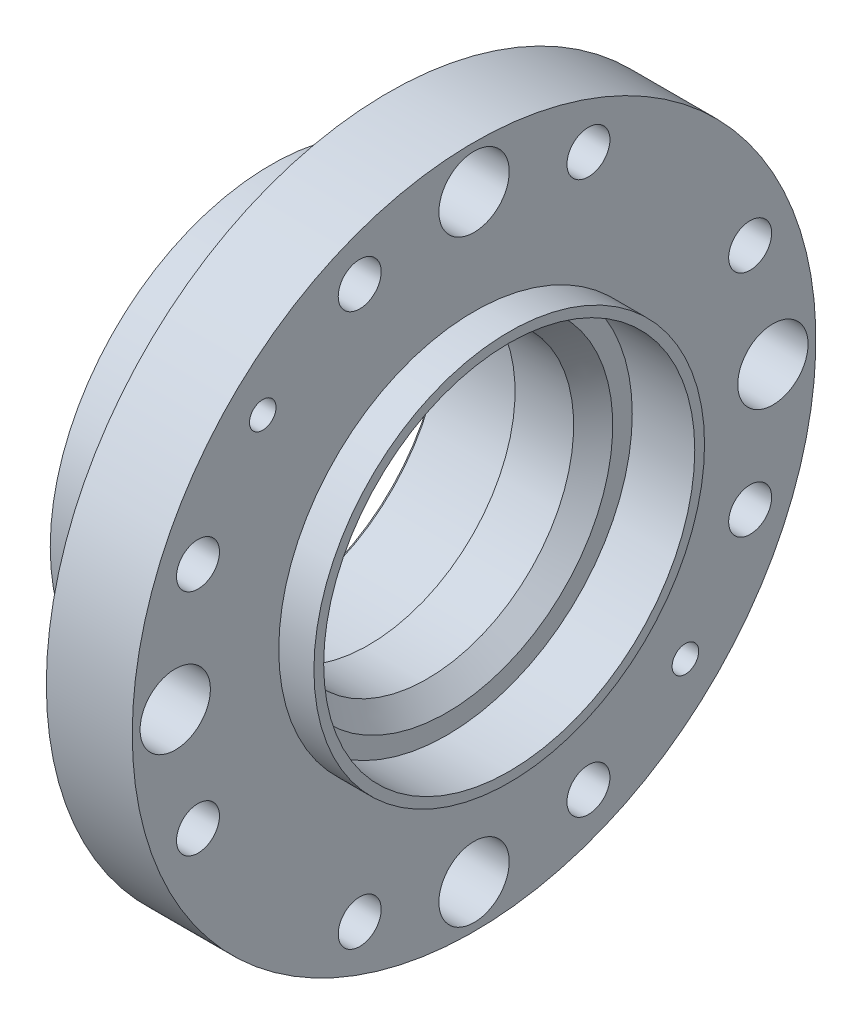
from build123d import *

# Parameters (mm, degrees)
ESQUISSE2_R                  = 5.5
EXTRUSION1_DEPTH             = 28
R_P_TITION_CIRCULAIRE1_COUNT = 4
ESQUISSE3_R                  = 9
EXTRUSION2_DEPTH             = 28
ESQUISSE4_R                  = 7.5
EXTRUSION3_DEPTH             = 10
TROU_TARAUD_M81_D            = 6.8
R_P_TITION_CIRCULAIRE2_COUNT = 2
CONG_3_R                     = 1
CHANFREIN1_SIZE              = 1
R_P_TITION_CIRCULAIRE4_COUNT = 8


with BuildPart() as part:
    # Esquisse1 → R_volution1 (revolve)
    with BuildSketch(Plane.XY, mode=Mode.PRIVATE) as r_volution1_sk:
        with BuildLine():
            Line((0.000200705, 56.500145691), (0.000200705, 42.49944927))
            Line((0.000200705, 42.49944927), (25.000200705, 42.49944927))
            Line((25.000200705, 42.49944927), (25.000200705, 37.498887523))
            Line((25.000200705, 37.498887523), (40.000200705, 37.498887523))
            Line((40.000200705, 37.498887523), (45.000200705, 42.498887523))
            Line((45.000200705, 42.498887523), (45.000200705, 47.498887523))
            Line((45.000200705, 47.498887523), (60.999813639, 47.498887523))
            Line((60.999813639, 47.498887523), (60.999813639, 49.999871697))
            Line((60.999813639, 49.999871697), (51.999813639, 49.999871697))
            Line((51.999813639, 49.999871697), (51.999813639, 87.499741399))
            Line((51.999813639, 87.499741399), (30.000394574, 87.499741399))
            Line((30.000394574, 87.499741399), (30.000394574, 64.500145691))
            ThreePointArc((30.000394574, 64.500145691), (27.657248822, 58.843291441), (22.000394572, 56.500145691))
            Line((22.000394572, 56.500145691), (0.000200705, 56.500145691))
        make_face()
    revolve(r_volution1_sk.sketch.rotate(Axis((0, 0, 0), (1, 0, 0)), 90), axis=Axis((0, 0, 0), (1, 0, 0)))

    # Esquisse2 → Extrusion1 (cut)
    with BuildSketch(Plane.ZY.offset(-30.000394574)):
        with Locations((-29.275282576, 70.676784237)):
            Circle(ESQUISSE2_R)
        with Locations((29.275575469, 70.677491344)):
            Circle(ESQUISSE2_R)
    extrusion1 = extrude(amount=-EXTRUSION1_DEPTH, mode=Mode.SUBTRACT)

    # R_p_tition circulaire1: Extrusion1 ×4 about axis
    r_p_tition_circulaire1_axis = Axis((0, 0, 0), (1, 0, 0))
    for i in range(1, R_P_TITION_CIRCULAIRE1_COUNT):
        add(extrusion1.rotate(r_p_tition_circulaire1_axis, i * 360 / R_P_TITION_CIRCULAIRE1_COUNT), mode=Mode.SUBTRACT)

    # Esquisse3 → Extrusion2 (cut)
    with BuildSketch(Plane.ZY.offset(-30.000394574)):
        with Locations((0, 76.5)):
            Circle(ESQUISSE3_R)
        with Locations((76.5, 0)):
            Circle(ESQUISSE3_R)
        with Locations((0, -76.5)):
            Circle(ESQUISSE3_R)
        with Locations((-76.5, 0)):
            Circle(ESQUISSE3_R)
    extrude(amount=-EXTRUSION2_DEPTH, mode=Mode.SUBTRACT)

    # Esquisse4 → Extrusion3 (cut)
    with BuildSketch(Plane.ZY.offset(-30.000394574)):
        with Locations((54.093668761, 54.093668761)):
            Circle(ESQUISSE4_R)
    extrusion3 = extrude(amount=-EXTRUSION3_DEPTH, mode=Mode.SUBTRACT)

    # Trou taraud_ M81 (through all)
    with Locations(Plane(origin=(40.000394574, 54.093668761, 54.093668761), x_dir=(0, 0, -1), z_dir=(-1, 0, 0))):
        with Locations((0, 0)):
            trou_taraud_m81 = Hole(TROU_TARAUD_M81_D / 2)

    # R_p_tition circulaire2: Extrusion3, Trou taraud_ M81 ×2 about axis
    r_p_tition_circulaire2_axis = Axis((0, 0, 0), (1, 0, 0))
    add([extrusion3.rotate(r_p_tition_circulaire2_axis, i * 360 / R_P_TITION_CIRCULAIRE2_COUNT) for i in range(1, R_P_TITION_CIRCULAIRE2_COUNT)], mode=Mode.SUBTRACT)
    add([trou_taraud_m81.rotate(r_p_tition_circulaire2_axis, i * 360 / R_P_TITION_CIRCULAIRE2_COUNT) for i in range(1, R_P_TITION_CIRCULAIRE2_COUNT)], mode=Mode.SUBTRACT)

    # Cong_3
    cong_3_edges = [part.edges().sort_by_distance(p)[0] for p in [
        (25.000200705, 0, -42.49944927),
    ]]
    fillet(cong_3_edges, radius=CONG_3_R)

    # Chanfrein1
    chanfrein1_edges = [part.edges().sort_by_distance(p)[0] for p in [
        (0.000200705, 0, -42.49944927),
    ]]
    chamfer(chanfrein1_edges, length=CHANFREIN1_SIZE)

    # Esquisse11 → Trou taraud_ M62 (revolve, cut)
    with BuildSketch(Plane(origin=(0.000200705, 48.5, 0), x_dir=(0, 0, 1), z_dir=(0, 1, 0))):
        Polygon((0, 0), (0, 19.502151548), (2.5, 18), (2.5, 0), align=None)
    trou_taraud_m62 = revolve(axis=Axis((-6.349799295, 48.5, 0), (1, 0, 0)), mode=Mode.SUBTRACT)

    # R_p_tition circulaire4: Trou taraud_ M62 ×8 about axis
    r_p_tition_circulaire4_axis = Axis((0, 0, 0), (1, 0, 0))
    for i in range(1, R_P_TITION_CIRCULAIRE4_COUNT):
        add(trou_taraud_m62.rotate(r_p_tition_circulaire4_axis, i * 360 / R_P_TITION_CIRCULAIRE4_COUNT), mode=Mode.SUBTRACT)


solid = part.part
